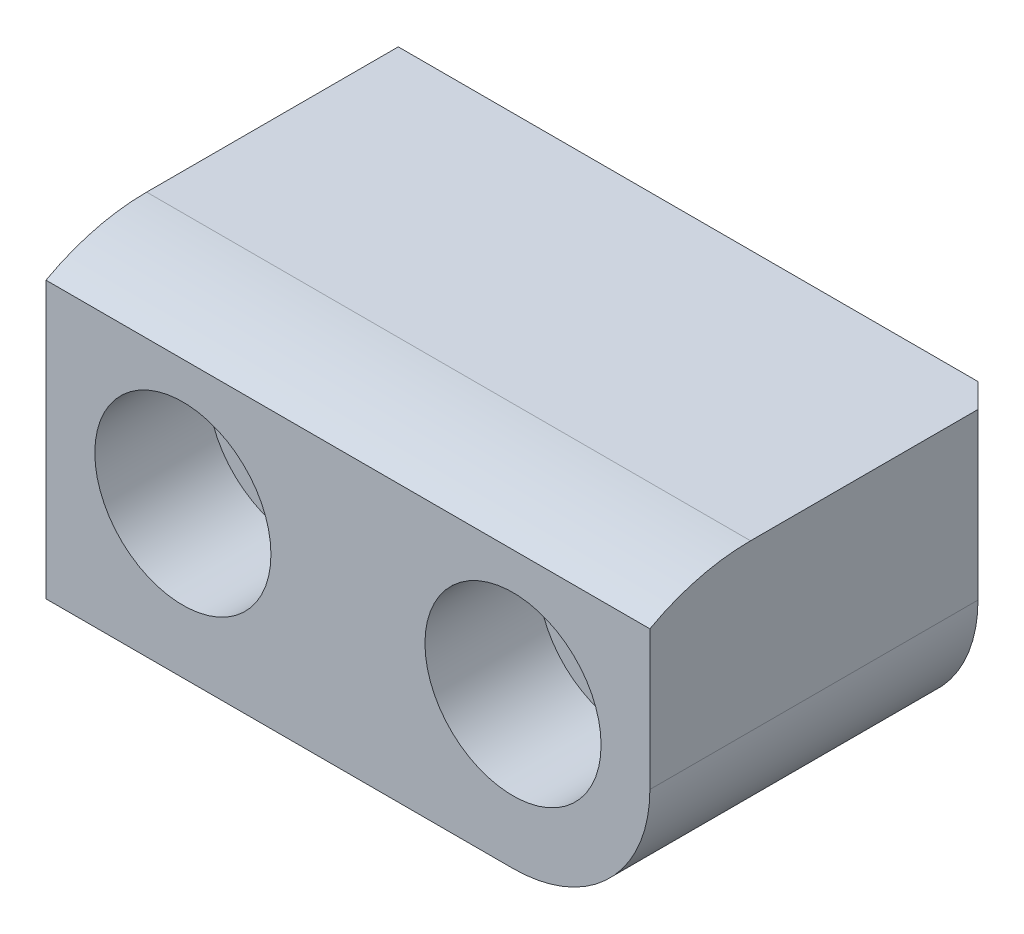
ISO-10303-21;
HEADER;
FILE_DESCRIPTION(('STEP AP214'),'2;1');
FILE_NAME('part.step','',(''),(''),'','','');
FILE_SCHEMA(('AUTOMOTIVE_DESIGN { 1 0 10303 214 1 1 1 1 }'));
ENDSEC;
DATA;
#1=APPLICATION_CONTEXT('core data for automotive mechanical design processes');
#2=APPLICATION_PROTOCOL_DEFINITION('international standard','automotive_design',2000,#1);
#3=PRODUCT_CONTEXT('',#1,'mechanical');
#4=PRODUCT('Part','Part','',(#3));
#5=PRODUCT_RELATED_PRODUCT_CATEGORY('part','',(#4));
#6=PRODUCT_DEFINITION_FORMATION('','',#4);
#7=PRODUCT_DEFINITION_CONTEXT('part definition',#1,'design');
#8=PRODUCT_DEFINITION('design','',#6,#7);
#9=PRODUCT_DEFINITION_SHAPE('','',#8);
#10=(LENGTH_UNIT() NAMED_UNIT(*) SI_UNIT(.MILLI.,.METRE.));
#11=(NAMED_UNIT(*) PLANE_ANGLE_UNIT() SI_UNIT($,.RADIAN.));
#12=(NAMED_UNIT(*) SI_UNIT($,.STERADIAN.) SOLID_ANGLE_UNIT());
#13=UNCERTAINTY_MEASURE_WITH_UNIT(LENGTH_MEASURE(1.E-05),#10,'distance_accuracy_value','');
#14=(GEOMETRIC_REPRESENTATION_CONTEXT(3) GLOBAL_UNCERTAINTY_ASSIGNED_CONTEXT((#13)) GLOBAL_UNIT_ASSIGNED_CONTEXT((#10,
#11,#12)) REPRESENTATION_CONTEXT('',''));
#15=CARTESIAN_POINT('',(0.,0.,0.));
#16=DIRECTION('',(0.,0.,1.));
#17=DIRECTION('',(1.,0.,0.));
#18=AXIS2_PLACEMENT_3D('',#15,#16,#17);
#19=CARTESIAN_POINT('',(0.,0.,-22.225));
#20=DIRECTION('',(-1.,0.,0.));
#21=DIRECTION('',(0.,-1.,0.));
#22=AXIS2_PLACEMENT_3D('',#19,#20,#21);
#23=PLANE('',#22);
#24=DIRECTION('',(0.,-1.,0.));
#25=VECTOR('',#24,1.);
#26=CARTESIAN_POINT('',(0.,0.,-22.225));
#27=LINE('',#26,#25);
#28=CARTESIAN_POINT('',(0.,0.,-22.225));
#29=VERTEX_POINT('',#28);
#30=CARTESIAN_POINT('',(0.,-17.526,-22.225));
#31=VERTEX_POINT('',#30);
#32=EDGE_CURVE('E127',#29,#31,#27,.T.);
#33=ORIENTED_EDGE('',*,*,#32,.T.);
#34=DIRECTION('',(0.,-0.707106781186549,0.707106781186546));
#35=VECTOR('',#34,1.);
#36=CARTESIAN_POINT('',(0.,-8.76299999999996,-30.988));
#37=LINE('',#36,#35);
#38=CARTESIAN_POINT('',(0.,-19.05,-20.701));
#39=VERTEX_POINT('',#38);
#40=EDGE_CURVE('E157',#31,#39,#37,.T.);
#41=ORIENTED_EDGE('',*,*,#40,.T.);
#42=DIRECTION('',(0.,0.,1.));
#43=VECTOR('',#42,1.);
#44=CARTESIAN_POINT('',(0.,-19.05,-22.225));
#45=LINE('',#44,#43);
#46=CARTESIAN_POINT('',(0.,-19.05,0.));
#47=VERTEX_POINT('',#46);
#48=EDGE_CURVE('E142',#39,#47,#45,.T.);
#49=ORIENTED_EDGE('',*,*,#48,.T.);
#50=DIRECTION('',(0.,-1.,0.));
#51=VECTOR('',#50,1.);
#52=CARTESIAN_POINT('',(0.,0.,0.));
#53=LINE('',#52,#51);
#54=CARTESIAN_POINT('',(0.,-1.63663731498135,0.));
#55=VERTEX_POINT('',#54);
#56=EDGE_CURVE('E133',#55,#47,#53,.T.);
#57=ORIENTED_EDGE('',*,*,#56,.F.);
#58=CARTESIAN_POINT('',(0.,-13.1370222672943,-6.35));
#59=DIRECTION('',(1.,0.,0.));
#60=DIRECTION('',(0.,1.,0.));
#61=AXIS2_PLACEMENT_3D('',#58,#59,#60);
#62=CIRCLE('',#61,13.1370222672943);
#63=CARTESIAN_POINT('',(0.,0.,-6.35));
#64=VERTEX_POINT('',#63);
#65=EDGE_CURVE('E110',#64,#55,#62,.T.);
#66=ORIENTED_EDGE('',*,*,#65,.F.);
#67=DIRECTION('',(0.,0.,1.));
#68=VECTOR('',#67,1.);
#69=CARTESIAN_POINT('',(0.,0.,-22.225));
#70=LINE('',#69,#68);
#71=EDGE_CURVE('E137',#29,#64,#70,.T.);
#72=ORIENTED_EDGE('',*,*,#71,.F.);
#73=EDGE_LOOP('',(#33,#41,#49,#57,#66,#72));
#74=FACE_BOUND('',#73,.T.);
#75=ADVANCED_FACE('F37',(#74),#23,.T.);
#76=CARTESIAN_POINT('',(0.,0.,-22.225));
#77=DIRECTION('',(0.,1.,0.));
#78=DIRECTION('',(0.,0.,1.));
#79=AXIS2_PLACEMENT_3D('',#76,#77,#78);
#80=PLANE('',#79);
#81=DIRECTION('',(0.,0.,1.));
#82=VECTOR('',#81,1.);
#83=CARTESIAN_POINT('',(38.1,0.,-22.225));
#84=LINE('',#83,#82);
#85=CARTESIAN_POINT('',(38.1,0.,-20.701));
#86=VERTEX_POINT('',#85);
#87=CARTESIAN_POINT('',(38.1,0.,-6.35));
#88=VERTEX_POINT('',#87);
#89=EDGE_CURVE('E120',#86,#88,#84,.T.);
#90=ORIENTED_EDGE('',*,*,#89,.F.);
#91=DIRECTION('',(-0.707106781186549,0.,-0.707106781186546));
#92=VECTOR('',#91,1.);
#93=CARTESIAN_POINT('',(18.2879999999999,0.,-40.513));
#94=LINE('',#93,#92);
#95=CARTESIAN_POINT('',(36.576,0.,-22.225));
#96=VERTEX_POINT('',#95);
#97=EDGE_CURVE('E11',#86,#96,#94,.T.);
#98=ORIENTED_EDGE('',*,*,#97,.T.);
#99=DIRECTION('',(-1.,0.,0.));
#100=VECTOR('',#99,1.);
#101=CARTESIAN_POINT('',(0.,0.,-22.225));
#102=LINE('',#101,#100);
#103=EDGE_CURVE('E131',#96,#29,#102,.T.);
#104=ORIENTED_EDGE('',*,*,#103,.T.);
#105=ORIENTED_EDGE('',*,*,#71,.T.);
#106=DIRECTION('',(-1.,0.,0.));
#107=VECTOR('',#106,1.);
#108=CARTESIAN_POINT('',(38.1,0.,-6.35));
#109=LINE('',#108,#107);
#110=EDGE_CURVE('E115',#88,#64,#109,.T.);
#111=ORIENTED_EDGE('',*,*,#110,.F.);
#112=EDGE_LOOP('',(#90,#98,#104,#105,#111));
#113=FACE_BOUND('',#112,.T.);
#114=ADVANCED_FACE('F207',(#113),#80,.T.);
#115=CARTESIAN_POINT('',(38.1,0.,-22.225));
#116=DIRECTION('',(1.,0.,0.));
#117=DIRECTION('',(0.,1.,0.));
#118=AXIS2_PLACEMENT_3D('',#115,#116,#117);
#119=PLANE('',#118);
#120=DIRECTION('',(0.,0.,1.));
#121=VECTOR('',#120,1.);
#122=CARTESIAN_POINT('',(38.1,-10.414,-22.225));
#123=LINE('',#122,#121);
#124=CARTESIAN_POINT('',(38.1,-10.414,0.));
#125=VERTEX_POINT('',#124);
#126=CARTESIAN_POINT('',(38.1,-10.414,-20.701));
#127=VERTEX_POINT('',#126);
#128=EDGE_CURVE('E146',#125,#127,#123,.F.);
#129=ORIENTED_EDGE('',*,*,#128,.T.);
#130=DIRECTION('',(0.,1.,0.));
#131=VECTOR('',#130,1.);
#132=CARTESIAN_POINT('',(38.1,0.,-20.701));
#133=LINE('',#132,#131);
#134=EDGE_CURVE('E46',#127,#86,#133,.T.);
#135=ORIENTED_EDGE('',*,*,#134,.T.);
#136=ORIENTED_EDGE('',*,*,#89,.T.);
#137=CARTESIAN_POINT('',(38.1,-13.1370222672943,-6.35));
#138=DIRECTION('',(1.,0.,0.));
#139=DIRECTION('',(0.,1.,0.));
#140=AXIS2_PLACEMENT_3D('',#137,#138,#139);
#141=CIRCLE('',#140,13.1370222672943);
#142=CARTESIAN_POINT('',(38.1,-1.63663731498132,0.));
#143=VERTEX_POINT('',#142);
#144=EDGE_CURVE('E107',#88,#143,#141,.T.);
#145=ORIENTED_EDGE('',*,*,#144,.T.);
#146=DIRECTION('',(0.,1.,0.));
#147=VECTOR('',#146,1.);
#148=CARTESIAN_POINT('',(38.1,0.,0.));
#149=LINE('',#148,#147);
#150=EDGE_CURVE('E119',#125,#143,#149,.T.);
#151=ORIENTED_EDGE('',*,*,#150,.F.);
#152=EDGE_LOOP('',(#129,#135,#136,#145,#151));
#153=FACE_BOUND('',#152,.T.);
#154=ADVANCED_FACE('F118',(#153),#119,.T.);
#155=CARTESIAN_POINT('',(0.,-19.05,-22.225));
#156=DIRECTION('',(0.,-1.,0.));
#157=DIRECTION('',(0.,0.,-1.));
#158=AXIS2_PLACEMENT_3D('',#155,#156,#157);
#159=PLANE('',#158);
#160=ORIENTED_EDGE('',*,*,#48,.F.);
#161=DIRECTION('',(1.,0.,0.));
#162=VECTOR('',#161,1.);
#163=CARTESIAN_POINT('',(29.464,-19.05,-20.701));
#164=LINE('',#163,#162);
#165=CARTESIAN_POINT('',(29.464,-19.05,-20.701));
#166=VERTEX_POINT('',#165);
#167=EDGE_CURVE('E148',#39,#166,#164,.T.);
#168=ORIENTED_EDGE('',*,*,#167,.T.);
#169=DIRECTION('',(0.,0.,1.));
#170=VECTOR('',#169,1.);
#171=CARTESIAN_POINT('',(29.464,-19.05,-22.225));
#172=LINE('',#171,#170);
#173=CARTESIAN_POINT('',(29.464,-19.05,0.));
#174=VERTEX_POINT('',#173);
#175=EDGE_CURVE('E140',#166,#174,#172,.T.);
#176=ORIENTED_EDGE('',*,*,#175,.T.);
#177=DIRECTION('',(1.,0.,0.));
#178=VECTOR('',#177,1.);
#179=CARTESIAN_POINT('',(0.,-19.05,0.));
#180=LINE('',#179,#178);
#181=EDGE_CURVE('E128',#47,#174,#180,.T.);
#182=ORIENTED_EDGE('',*,*,#181,.F.);
#183=EDGE_LOOP('',(#160,#168,#176,#182));
#184=FACE_BOUND('',#183,.T.);
#185=ADVANCED_FACE('F200',(#184),#159,.T.);
#186=CARTESIAN_POINT('',(0.,-19.05,-22.225));
#187=DIRECTION('',(0.,0.,1.));
#188=DIRECTION('',(1.,0.,0.));
#189=AXIS2_PLACEMENT_3D('',#186,#187,#188);
#190=PLANE('',#189);
#191=CARTESIAN_POINT('',(8.636,-9.525,-22.225));
#192=DIRECTION('',(0.,0.,1.));
#193=DIRECTION('',(1.,0.,0.));
#194=AXIS2_PLACEMENT_3D('',#191,#192,#193);
#195=CIRCLE('',#194,3.2639);
#196=CARTESIAN_POINT('',(11.8999,-9.525,-22.225));
#197=VERTEX_POINT('',#196);
#198=EDGE_CURVE('E181',#197,#197,#195,.T.);
#199=ORIENTED_EDGE('',*,*,#198,.T.);
#200=EDGE_LOOP('',(#199));
#201=FACE_BOUND('',#200,.T.);
#202=CARTESIAN_POINT('',(29.464,-9.525,-22.225));
#203=DIRECTION('',(0.,0.,1.));
#204=DIRECTION('',(1.,0.,0.));
#205=AXIS2_PLACEMENT_3D('',#202,#203,#204);
#206=CIRCLE('',#205,3.26389999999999);
#207=CARTESIAN_POINT('',(32.7279,-9.525,-22.225));
#208=VERTEX_POINT('',#207);
#209=EDGE_CURVE('E193',#208,#208,#206,.T.);
#210=ORIENTED_EDGE('',*,*,#209,.T.);
#211=EDGE_LOOP('',(#210));
#212=FACE_BOUND('',#211,.T.);
#213=CARTESIAN_POINT('',(29.464,-10.414,-22.225));
#214=DIRECTION('',(0.,0.,1.));
#215=DIRECTION('',(1.,0.,0.));
#216=AXIS2_PLACEMENT_3D('',#213,#214,#215);
#217=CIRCLE('',#216,7.11199999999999);
#218=CARTESIAN_POINT('',(36.576,-10.414,-22.225));
#219=VERTEX_POINT('',#218);
#220=CARTESIAN_POINT('',(29.464,-17.526,-22.225));
#221=VERTEX_POINT('',#220);
#222=EDGE_CURVE('E153',#219,#221,#217,.F.);
#223=ORIENTED_EDGE('',*,*,#222,.T.);
#224=DIRECTION('',(-1.,0.,0.));
#225=VECTOR('',#224,1.);
#226=CARTESIAN_POINT('',(0.,-17.526,-22.225));
#227=LINE('',#226,#225);
#228=EDGE_CURVE('E155',#221,#31,#227,.T.);
#229=ORIENTED_EDGE('',*,*,#228,.T.);
#230=ORIENTED_EDGE('',*,*,#32,.F.);
#231=ORIENTED_EDGE('',*,*,#103,.F.);
#232=DIRECTION('',(0.,-1.,0.));
#233=VECTOR('',#232,1.);
#234=CARTESIAN_POINT('',(36.576,-10.414,-22.225));
#235=LINE('',#234,#233);
#236=EDGE_CURVE('E151',#96,#219,#235,.T.);
#237=ORIENTED_EDGE('',*,*,#236,.T.);
#238=EDGE_LOOP('',(#223,#229,#230,#231,#237));
#239=FACE_BOUND('',#238,.T.);
#240=ADVANCED_FACE('F211',(#201,#212,#239),#190,.F.);
#241=CARTESIAN_POINT('',(0.,-19.05,0.));
#242=DIRECTION('',(0.,0.,1.));
#243=DIRECTION('',(1.,0.,0.));
#244=AXIS2_PLACEMENT_3D('',#241,#242,#243);
#245=PLANE('',#244);
#246=DIRECTION('',(-1.,0.,0.));
#247=VECTOR('',#246,1.);
#248=CARTESIAN_POINT('',(38.1,-1.63663731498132,0.));
#249=LINE('',#248,#247);
#250=EDGE_CURVE('E104',#143,#55,#249,.T.);
#251=ORIENTED_EDGE('',*,*,#250,.T.);
#252=ORIENTED_EDGE('',*,*,#56,.T.);
#253=ORIENTED_EDGE('',*,*,#181,.T.);
#254=CARTESIAN_POINT('',(29.464,-10.414,0.));
#255=DIRECTION('',(0.,0.,1.));
#256=DIRECTION('',(1.,0.,0.));
#257=AXIS2_PLACEMENT_3D('',#254,#255,#256);
#258=CIRCLE('',#257,8.636);
#259=EDGE_CURVE('E126',#174,#125,#258,.T.);
#260=ORIENTED_EDGE('',*,*,#259,.T.);
#261=ORIENTED_EDGE('',*,*,#150,.T.);
#262=EDGE_LOOP('',(#251,#252,#253,#260,#261));
#263=FACE_BOUND('',#262,.T.);
#264=CARTESIAN_POINT('',(8.636,-9.525,0.));
#265=DIRECTION('',(0.,0.,1.));
#266=DIRECTION('',(1.,0.,0.));
#267=AXIS2_PLACEMENT_3D('',#264,#265,#266);
#268=CIRCLE('',#267,5.55625);
#269=CARTESIAN_POINT('',(14.19225,-9.525,0.));
#270=VERTEX_POINT('',#269);
#271=EDGE_CURVE('E171',#270,#270,#268,.T.);
#272=ORIENTED_EDGE('',*,*,#271,.F.);
#273=EDGE_LOOP('',(#272));
#274=FACE_BOUND('',#273,.T.);
#275=CARTESIAN_POINT('',(29.464,-9.525,0.));
#276=DIRECTION('',(0.,0.,1.));
#277=DIRECTION('',(1.,0.,0.));
#278=AXIS2_PLACEMENT_3D('',#275,#276,#277);
#279=CIRCLE('',#278,5.55625);
#280=CARTESIAN_POINT('',(35.02025,-9.525,0.));
#281=VERTEX_POINT('',#280);
#282=EDGE_CURVE('E184',#281,#281,#279,.T.);
#283=ORIENTED_EDGE('',*,*,#282,.F.);
#284=EDGE_LOOP('',(#283));
#285=FACE_BOUND('',#284,.T.);
#286=ADVANCED_FACE('F122',(#263,#274,#285),#245,.T.);
#287=CARTESIAN_POINT('',(29.464,-10.414,-22.225));
#288=DIRECTION('',(0.,0.,1.));
#289=DIRECTION('',(1.,0.,0.));
#290=AXIS2_PLACEMENT_3D('',#287,#288,#289);
#291=CYLINDRICAL_SURFACE('',#290,8.636);
#292=ORIENTED_EDGE('',*,*,#175,.F.);
#293=CARTESIAN_POINT('',(29.464,-10.414,-20.701));
#294=DIRECTION('',(0.,0.,1.));
#295=DIRECTION('',(1.,0.,0.));
#296=AXIS2_PLACEMENT_3D('',#293,#294,#295);
#297=CIRCLE('',#296,8.636);
#298=EDGE_CURVE('E61',#166,#127,#297,.T.);
#299=ORIENTED_EDGE('',*,*,#298,.T.);
#300=ORIENTED_EDGE('',*,*,#128,.F.);
#301=ORIENTED_EDGE('',*,*,#259,.F.);
#302=EDGE_LOOP('',(#292,#299,#300,#301));
#303=FACE_BOUND('',#302,.T.);
#304=ADVANCED_FACE('F201',(#303),#291,.T.);
#305=CARTESIAN_POINT('',(29.464,-9.525,0.));
#306=DIRECTION('',(0.,0.,1.));
#307=DIRECTION('',(1.,0.,0.));
#308=AXIS2_PLACEMENT_3D('',#305,#306,#307);
#309=CYLINDRICAL_SURFACE('',#308,3.2639);
#310=ORIENTED_EDGE('',*,*,#209,.F.);
#311=EDGE_LOOP('',(#310));
#312=FACE_BOUND('',#311,.T.);
#313=CARTESIAN_POINT('',(29.464,-9.525,-7.14375));
#314=DIRECTION('',(0.,0.,1.));
#315=DIRECTION('',(1.,0.,0.));
#316=AXIS2_PLACEMENT_3D('',#313,#314,#315);
#317=CIRCLE('',#316,3.2639);
#318=CARTESIAN_POINT('',(32.7279,-9.525,-7.14375));
#319=VERTEX_POINT('',#318);
#320=EDGE_CURVE('E190',#319,#319,#317,.T.);
#321=ORIENTED_EDGE('',*,*,#320,.T.);
#322=EDGE_LOOP('',(#321));
#323=FACE_BOUND('',#322,.T.);
#324=ADVANCED_FACE('F231',(#312,#323),#309,.F.);
#325=CARTESIAN_POINT('',(32.7279,-9.525,-7.14375));
#326=DIRECTION('',(0.,0.,-1.));
#327=DIRECTION('',(-1.,0.,0.));
#328=AXIS2_PLACEMENT_3D('',#325,#326,#327);
#329=PLANE('',#328);
#330=ORIENTED_EDGE('',*,*,#320,.F.);
#331=EDGE_LOOP('',(#330));
#332=FACE_BOUND('',#331,.T.);
#333=CARTESIAN_POINT('',(29.464,-9.525,-7.14375));
#334=DIRECTION('',(0.,0.,1.));
#335=DIRECTION('',(1.,0.,0.));
#336=AXIS2_PLACEMENT_3D('',#333,#334,#335);
#337=CIRCLE('',#336,5.55625);
#338=CARTESIAN_POINT('',(35.02025,-9.525,-7.14375));
#339=VERTEX_POINT('',#338);
#340=EDGE_CURVE('E187',#339,#339,#337,.T.);
#341=ORIENTED_EDGE('',*,*,#340,.T.);
#342=EDGE_LOOP('',(#341));
#343=FACE_BOUND('',#342,.T.);
#344=ADVANCED_FACE('F236',(#332,#343),#329,.F.);
#345=CARTESIAN_POINT('',(29.464,-9.525,0.));
#346=DIRECTION('',(0.,0.,1.));
#347=DIRECTION('',(1.,0.,0.));
#348=AXIS2_PLACEMENT_3D('',#345,#346,#347);
#349=CYLINDRICAL_SURFACE('',#348,5.55625);
#350=ORIENTED_EDGE('',*,*,#340,.F.);
#351=EDGE_LOOP('',(#350));
#352=FACE_BOUND('',#351,.T.);
#353=ORIENTED_EDGE('',*,*,#282,.T.);
#354=EDGE_LOOP('',(#353));
#355=FACE_BOUND('',#354,.T.);
#356=ADVANCED_FACE('F323',(#352,#355),#349,.F.);
#357=CARTESIAN_POINT('',(8.636,-9.525,0.));
#358=DIRECTION('',(0.,0.,1.));
#359=DIRECTION('',(1.,0.,0.));
#360=AXIS2_PLACEMENT_3D('',#357,#358,#359);
#361=CYLINDRICAL_SURFACE('',#360,3.2639);
#362=ORIENTED_EDGE('',*,*,#198,.F.);
#363=EDGE_LOOP('',(#362));
#364=FACE_BOUND('',#363,.T.);
#365=CARTESIAN_POINT('',(8.636,-9.525,-7.14375));
#366=DIRECTION('',(0.,0.,1.));
#367=DIRECTION('',(1.,0.,0.));
#368=AXIS2_PLACEMENT_3D('',#365,#366,#367);
#369=CIRCLE('',#368,3.2639);
#370=CARTESIAN_POINT('',(11.8999,-9.525,-7.14375));
#371=VERTEX_POINT('',#370);
#372=EDGE_CURVE('E178',#371,#371,#369,.T.);
#373=ORIENTED_EDGE('',*,*,#372,.T.);
#374=EDGE_LOOP('',(#373));
#375=FACE_BOUND('',#374,.T.);
#376=ADVANCED_FACE('F313',(#364,#375),#361,.F.);
#377=CARTESIAN_POINT('',(11.8999,-9.525,-7.14375));
#378=DIRECTION('',(0.,0.,-1.));
#379=DIRECTION('',(-1.,0.,0.));
#380=AXIS2_PLACEMENT_3D('',#377,#378,#379);
#381=PLANE('',#380);
#382=ORIENTED_EDGE('',*,*,#372,.F.);
#383=EDGE_LOOP('',(#382));
#384=FACE_BOUND('',#383,.T.);
#385=CARTESIAN_POINT('',(8.636,-9.525,-7.14375));
#386=DIRECTION('',(0.,0.,1.));
#387=DIRECTION('',(1.,0.,0.));
#388=AXIS2_PLACEMENT_3D('',#385,#386,#387);
#389=CIRCLE('',#388,5.55625);
#390=CARTESIAN_POINT('',(14.19225,-9.525,-7.14375));
#391=VERTEX_POINT('',#390);
#392=EDGE_CURVE('E175',#391,#391,#389,.T.);
#393=ORIENTED_EDGE('',*,*,#392,.T.);
#394=EDGE_LOOP('',(#393));
#395=FACE_BOUND('',#394,.T.);
#396=ADVANCED_FACE('F303',(#384,#395),#381,.F.);
#397=CARTESIAN_POINT('',(8.636,-9.525,0.));
#398=DIRECTION('',(0.,0.,1.));
#399=DIRECTION('',(1.,0.,0.));
#400=AXIS2_PLACEMENT_3D('',#397,#398,#399);
#401=CYLINDRICAL_SURFACE('',#400,5.55625);
#402=ORIENTED_EDGE('',*,*,#392,.F.);
#403=EDGE_LOOP('',(#402));
#404=FACE_BOUND('',#403,.T.);
#405=ORIENTED_EDGE('',*,*,#271,.T.);
#406=EDGE_LOOP('',(#405));
#407=FACE_BOUND('',#406,.T.);
#408=ADVANCED_FACE('F294',(#404,#407),#401,.F.);
#409=CARTESIAN_POINT('',(38.1,-13.1370222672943,-6.35));
#410=DIRECTION('',(-1.,0.,0.));
#411=DIRECTION('',(0.,-1.,0.));
#412=AXIS2_PLACEMENT_3D('',#409,#410,#411);
#413=CYLINDRICAL_SURFACE('',#412,13.1370222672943);
#414=ORIENTED_EDGE('',*,*,#65,.T.);
#415=ORIENTED_EDGE('',*,*,#250,.F.);
#416=ORIENTED_EDGE('',*,*,#144,.F.);
#417=ORIENTED_EDGE('',*,*,#110,.T.);
#418=EDGE_LOOP('',(#414,#415,#416,#417));
#419=FACE_BOUND('',#418,.T.);
#420=ADVANCED_FACE('F106',(#419),#413,.T.);
#421=CARTESIAN_POINT('',(38.1,0.,-20.701));
#422=DIRECTION('',(0.707106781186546,0.,-0.707106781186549));
#423=DIRECTION('',(0.,-1.,0.));
#424=AXIS2_PLACEMENT_3D('',#421,#422,#423);
#425=PLANE('',#424);
#426=ORIENTED_EDGE('',*,*,#97,.F.);
#427=ORIENTED_EDGE('',*,*,#134,.F.);
#428=DIRECTION('',(0.707106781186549,0.,0.707106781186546));
#429=VECTOR('',#428,1.);
#430=CARTESIAN_POINT('',(36.576,-10.414,-22.225));
#431=LINE('',#430,#429);
#432=EDGE_CURVE('E41',#219,#127,#431,.T.);
#433=ORIENTED_EDGE('',*,*,#432,.F.);
#434=ORIENTED_EDGE('',*,*,#236,.F.);
#435=EDGE_LOOP('',(#426,#427,#433,#434));
#436=FACE_BOUND('',#435,.T.);
#437=ADVANCED_FACE('F39',(#436),#425,.T.);
#438=CARTESIAN_POINT('',(29.464,-10.414,-22.225));
#439=DIRECTION('',(0.,0.,1.));
#440=DIRECTION('',(1.,0.,0.));
#441=AXIS2_PLACEMENT_3D('',#438,#439,#440);
#442=CONICAL_SURFACE('',#441,7.11199999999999,0.785398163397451);
#443=ORIENTED_EDGE('',*,*,#432,.T.);
#444=ORIENTED_EDGE('',*,*,#298,.F.);
#445=DIRECTION('',(0.,-0.707106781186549,0.707106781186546));
#446=VECTOR('',#445,1.);
#447=CARTESIAN_POINT('',(29.464,-17.526,-22.225));
#448=LINE('',#447,#446);
#449=EDGE_CURVE('E160',#221,#166,#448,.T.);
#450=ORIENTED_EDGE('',*,*,#449,.F.);
#451=ORIENTED_EDGE('',*,*,#222,.F.);
#452=EDGE_LOOP('',(#443,#444,#450,#451));
#453=FACE_BOUND('',#452,.T.);
#454=ADVANCED_FACE('F214',(#453),#442,.T.);
#455=CARTESIAN_POINT('',(0.,-19.05,-20.701));
#456=DIRECTION('',(0.,-0.707106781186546,-0.707106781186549));
#457=DIRECTION('',(-1.,0.,0.));
#458=AXIS2_PLACEMENT_3D('',#455,#456,#457);
#459=PLANE('',#458);
#460=ORIENTED_EDGE('',*,*,#40,.F.);
#461=ORIENTED_EDGE('',*,*,#228,.F.);
#462=ORIENTED_EDGE('',*,*,#449,.T.);
#463=ORIENTED_EDGE('',*,*,#167,.F.);
#464=EDGE_LOOP('',(#460,#461,#462,#463));
#465=FACE_BOUND('',#464,.T.);
#466=ADVANCED_FACE('F213',(#465),#459,.T.);
#467=CLOSED_SHELL('',(#75,#114,#154,#185,#240,#286,#304,#324,#344,#356,#376,#396,#408,#420,#437,
#454,#466));
#468=MANIFOLD_SOLID_BREP('B2',#467);
#469=ADVANCED_BREP_SHAPE_REPRESENTATION('',(#18,#468),#14);
#470=SHAPE_DEFINITION_REPRESENTATION(#9,#469);
ENDSEC;
END-ISO-10303-21;
